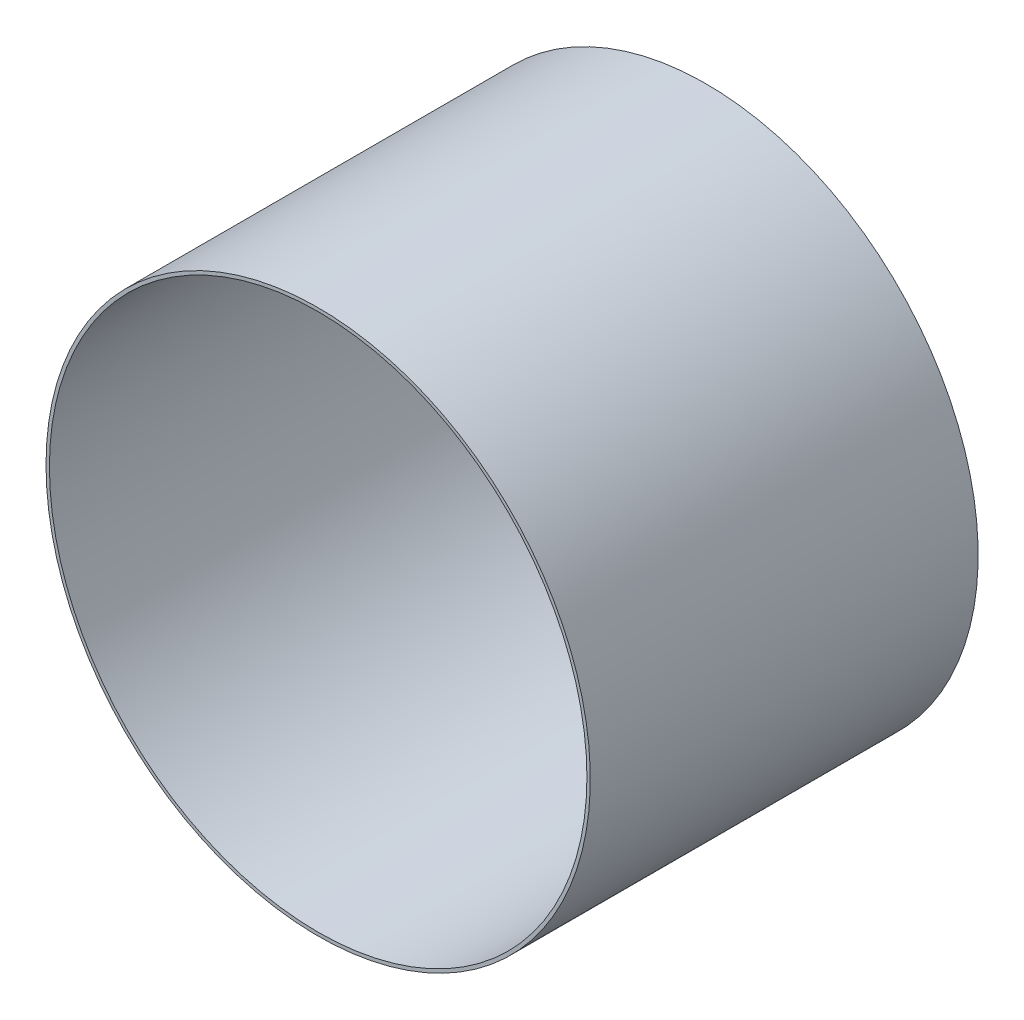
ISO-10303-21;
HEADER;
FILE_DESCRIPTION(('STEP AP214'),'2;1');
FILE_NAME('part.step','',(''),(''),'','','');
FILE_SCHEMA(('AUTOMOTIVE_DESIGN { 1 0 10303 214 1 1 1 1 }'));
ENDSEC;
DATA;
#1=APPLICATION_CONTEXT('core data for automotive mechanical design processes');
#2=APPLICATION_PROTOCOL_DEFINITION('international standard','automotive_design',2000,#1);
#3=PRODUCT_CONTEXT('',#1,'mechanical');
#4=PRODUCT('Part','Part','',(#3));
#5=PRODUCT_RELATED_PRODUCT_CATEGORY('part','',(#4));
#6=PRODUCT_DEFINITION_FORMATION('','',#4);
#7=PRODUCT_DEFINITION_CONTEXT('part definition',#1,'design');
#8=PRODUCT_DEFINITION('design','',#6,#7);
#9=PRODUCT_DEFINITION_SHAPE('','',#8);
#10=(LENGTH_UNIT() NAMED_UNIT(*) SI_UNIT(.MILLI.,.METRE.));
#11=(NAMED_UNIT(*) PLANE_ANGLE_UNIT() SI_UNIT($,.RADIAN.));
#12=(NAMED_UNIT(*) SI_UNIT($,.STERADIAN.) SOLID_ANGLE_UNIT());
#13=UNCERTAINTY_MEASURE_WITH_UNIT(LENGTH_MEASURE(1.E-05),#10,'distance_accuracy_value','');
#14=(GEOMETRIC_REPRESENTATION_CONTEXT(3) GLOBAL_UNCERTAINTY_ASSIGNED_CONTEXT((#13)) GLOBAL_UNIT_ASSIGNED_CONTEXT((#10,
#11,#12)) REPRESENTATION_CONTEXT('',''));
#15=CARTESIAN_POINT('',(0.,0.,0.));
#16=DIRECTION('',(0.,0.,1.));
#17=DIRECTION('',(1.,0.,0.));
#18=AXIS2_PLACEMENT_3D('',#15,#16,#17);
#19=CARTESIAN_POINT('',(0.,0.,228.));
#20=DIRECTION('',(0.,0.,1.));
#21=DIRECTION('',(1.,0.,0.));
#22=AXIS2_PLACEMENT_3D('',#19,#20,#21);
#23=PLANE('',#22);
#24=CARTESIAN_POINT('',(0.,0.,228.));
#25=DIRECTION('',(0.,0.,1.));
#26=DIRECTION('',(1.,0.,0.));
#27=AXIS2_PLACEMENT_3D('',#24,#25,#26);
#28=CIRCLE('',#27,160.);
#29=CARTESIAN_POINT('',(-160.,0.,228.));
#30=VERTEX_POINT('',#29);
#31=EDGE_CURVE('E10',#30,#30,#28,.T.);
#32=ORIENTED_EDGE('',*,*,#31,.T.);
#33=EDGE_LOOP('',(#32));
#34=FACE_BOUND('',#33,.T.);
#35=CARTESIAN_POINT('',(0.,0.,228.));
#36=DIRECTION('',(0.,0.,1.));
#37=DIRECTION('',(1.,0.,0.));
#38=AXIS2_PLACEMENT_3D('',#35,#36,#37);
#39=CIRCLE('',#38,158.);
#40=CARTESIAN_POINT('',(-158.,0.,228.));
#41=VERTEX_POINT('',#40);
#42=EDGE_CURVE('E41',#41,#41,#39,.T.);
#43=ORIENTED_EDGE('',*,*,#42,.F.);
#44=EDGE_LOOP('',(#43));
#45=FACE_BOUND('',#44,.T.);
#46=ADVANCED_FACE('F30',(#34,#45),#23,.T.);
#47=CARTESIAN_POINT('',(0.,0.,0.));
#48=DIRECTION('',(0.,0.,1.));
#49=DIRECTION('',(1.,0.,0.));
#50=AXIS2_PLACEMENT_3D('',#47,#48,#49);
#51=PLANE('',#50);
#52=CARTESIAN_POINT('',(0.,0.,0.));
#53=DIRECTION('',(0.,0.,1.));
#54=DIRECTION('',(1.,0.,0.));
#55=AXIS2_PLACEMENT_3D('',#52,#53,#54);
#56=CIRCLE('',#55,160.);
#57=CARTESIAN_POINT('',(-160.,0.,0.));
#58=VERTEX_POINT('',#57);
#59=EDGE_CURVE('E34',#58,#58,#56,.T.);
#60=ORIENTED_EDGE('',*,*,#59,.F.);
#61=EDGE_LOOP('',(#60));
#62=FACE_BOUND('',#61,.T.);
#63=CARTESIAN_POINT('',(0.,0.,0.));
#64=DIRECTION('',(0.,0.,1.));
#65=DIRECTION('',(1.,0.,0.));
#66=AXIS2_PLACEMENT_3D('',#63,#64,#65);
#67=CIRCLE('',#66,158.);
#68=CARTESIAN_POINT('',(-158.,0.,0.));
#69=VERTEX_POINT('',#68);
#70=EDGE_CURVE('E43',#69,#69,#67,.T.);
#71=ORIENTED_EDGE('',*,*,#70,.T.);
#72=EDGE_LOOP('',(#71));
#73=FACE_BOUND('',#72,.T.);
#74=ADVANCED_FACE('F53',(#62,#73),#51,.F.);
#75=CARTESIAN_POINT('',(0.,0.,228.));
#76=DIRECTION('',(0.,0.,-1.));
#77=DIRECTION('',(-1.,0.,0.));
#78=AXIS2_PLACEMENT_3D('',#75,#76,#77);
#79=CYLINDRICAL_SURFACE('',#78,160.);
#80=CARTESIAN_POINT('',(-160.,0.,228.));
#81=CARTESIAN_POINT('',(-160.,0.,225.625));
#82=CARTESIAN_POINT('',(-160.,0.,223.25));
#83=CARTESIAN_POINT('',(-160.,0.,218.5));
#84=CARTESIAN_POINT('',(-160.,0.,216.125));
#85=CARTESIAN_POINT('',(-160.,0.,211.375));
#86=CARTESIAN_POINT('',(-160.,0.,209.));
#87=CARTESIAN_POINT('',(-160.,0.,204.25));
#88=CARTESIAN_POINT('',(-160.,0.,201.875));
#89=CARTESIAN_POINT('',(-160.,0.,197.125));
#90=CARTESIAN_POINT('',(-160.,0.,194.75));
#91=CARTESIAN_POINT('',(-160.,0.,190.));
#92=CARTESIAN_POINT('',(-160.,0.,187.625));
#93=CARTESIAN_POINT('',(-160.,0.,182.875));
#94=CARTESIAN_POINT('',(-160.,0.,180.5));
#95=CARTESIAN_POINT('',(-160.,0.,175.75));
#96=CARTESIAN_POINT('',(-160.,0.,173.375));
#97=CARTESIAN_POINT('',(-160.,0.,168.625));
#98=CARTESIAN_POINT('',(-160.,0.,166.25));
#99=CARTESIAN_POINT('',(-160.,0.,161.5));
#100=CARTESIAN_POINT('',(-160.,0.,159.125));
#101=CARTESIAN_POINT('',(-160.,0.,154.375));
#102=CARTESIAN_POINT('',(-160.,0.,152.));
#103=CARTESIAN_POINT('',(-160.,0.,147.25));
#104=CARTESIAN_POINT('',(-160.,0.,144.875));
#105=CARTESIAN_POINT('',(-160.,0.,140.125));
#106=CARTESIAN_POINT('',(-160.,0.,137.75));
#107=CARTESIAN_POINT('',(-160.,0.,133.));
#108=CARTESIAN_POINT('',(-160.,0.,130.625));
#109=CARTESIAN_POINT('',(-160.,0.,125.875));
#110=CARTESIAN_POINT('',(-160.,0.,123.5));
#111=CARTESIAN_POINT('',(-160.,0.,118.75));
#112=CARTESIAN_POINT('',(-160.,0.,116.375));
#113=CARTESIAN_POINT('',(-160.,0.,111.625));
#114=CARTESIAN_POINT('',(-160.,0.,109.25));
#115=CARTESIAN_POINT('',(-160.,0.,104.5));
#116=CARTESIAN_POINT('',(-160.,0.,102.125));
#117=CARTESIAN_POINT('',(-160.,0.,97.375));
#118=CARTESIAN_POINT('',(-160.,0.,95.));
#119=CARTESIAN_POINT('',(-160.,0.,90.25));
#120=CARTESIAN_POINT('',(-160.,0.,87.875));
#121=CARTESIAN_POINT('',(-160.,0.,83.125));
#122=CARTESIAN_POINT('',(-160.,0.,80.75));
#123=CARTESIAN_POINT('',(-160.,0.,76.));
#124=CARTESIAN_POINT('',(-160.,0.,73.625));
#125=CARTESIAN_POINT('',(-160.,0.,68.875));
#126=CARTESIAN_POINT('',(-160.,0.,66.5));
#127=CARTESIAN_POINT('',(-160.,0.,61.75));
#128=CARTESIAN_POINT('',(-160.,0.,59.375));
#129=CARTESIAN_POINT('',(-160.,0.,54.625));
#130=CARTESIAN_POINT('',(-160.,0.,52.25));
#131=CARTESIAN_POINT('',(-160.,0.,47.5));
#132=CARTESIAN_POINT('',(-160.,0.,45.125));
#133=CARTESIAN_POINT('',(-160.,0.,40.375));
#134=CARTESIAN_POINT('',(-160.,0.,38.));
#135=CARTESIAN_POINT('',(-160.,0.,33.25));
#136=CARTESIAN_POINT('',(-160.,0.,30.875));
#137=CARTESIAN_POINT('',(-160.,0.,26.125));
#138=CARTESIAN_POINT('',(-160.,0.,23.75));
#139=CARTESIAN_POINT('',(-160.,0.,19.));
#140=CARTESIAN_POINT('',(-160.,0.,16.625));
#141=CARTESIAN_POINT('',(-160.,0.,11.875));
#142=CARTESIAN_POINT('',(-160.,0.,9.5));
#143=CARTESIAN_POINT('',(-160.,0.,4.75));
#144=CARTESIAN_POINT('',(-160.,0.,2.375));
#145=CARTESIAN_POINT('',(-160.,0.,0.));
#146=B_SPLINE_CURVE_WITH_KNOTS('',3,(#80,#81,#82,#83,#84,#85,#86,#87,#88,#89,#90,#91,#92,#93,
#94,#95,#96,#97,#98,#99,#100,#101,#102,#103,#104,#105,#106,#107,#108,#109,#110,#111,#112,#113,
#114,#115,#116,#117,#118,#119,#120,#121,#122,#123,#124,#125,#126,#127,#128,#129,#130,#131,#132,
#133,#134,#135,#136,#137,#138,#139,#140,#141,#142,#143,#144,#145),.UNSPECIFIED.,.F.,.F.,(4,2,2,
2,2,2,2,2,2,2,2,2,2,2,2,2,2,2,2,2,2,2,2,2,2,2,2,2,2,2,2,2,4),(0.,7.12500000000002,14.25,21.375,
28.5,35.625,42.75,49.875,57.,64.125,71.25,78.375,85.5,92.625,99.75,106.875,114.,121.125,128.25,
135.375,142.5,149.625,156.75,163.875,171.,178.125,185.25,192.375,199.5,206.625,213.75,220.875,
228.),.UNSPECIFIED.);
#147=EDGE_CURVE('BSEAM32',#30,#58,#146,.T.);
#148=ORIENTED_EDGE('',*,*,#31,.F.);
#149=ORIENTED_EDGE('',*,*,#59,.T.);
#150=ORIENTED_EDGE('',*,*,#147,.T.);
#151=ORIENTED_EDGE('',*,*,#147,.F.);
#152=EDGE_LOOP('',(#148,#150,#149,#151));
#153=FACE_BOUND('',#152,.T.);
#154=ADVANCED_FACE('F32',(#153),#79,.T.);
#155=CARTESIAN_POINT('',(0.,0.,228.));
#156=DIRECTION('',(0.,0.,-1.));
#157=DIRECTION('',(-1.,0.,0.));
#158=AXIS2_PLACEMENT_3D('',#155,#156,#157);
#159=CYLINDRICAL_SURFACE('',#158,158.);
#160=CARTESIAN_POINT('',(-158.,0.,228.));
#161=CARTESIAN_POINT('',(-158.,0.,225.625));
#162=CARTESIAN_POINT('',(-158.,0.,223.25));
#163=CARTESIAN_POINT('',(-158.,0.,218.5));
#164=CARTESIAN_POINT('',(-158.,0.,216.125));
#165=CARTESIAN_POINT('',(-158.,0.,211.375));
#166=CARTESIAN_POINT('',(-158.,0.,209.));
#167=CARTESIAN_POINT('',(-158.,0.,204.25));
#168=CARTESIAN_POINT('',(-158.,0.,201.875));
#169=CARTESIAN_POINT('',(-158.,0.,197.125));
#170=CARTESIAN_POINT('',(-158.,0.,194.75));
#171=CARTESIAN_POINT('',(-158.,0.,190.));
#172=CARTESIAN_POINT('',(-158.,0.,187.625));
#173=CARTESIAN_POINT('',(-158.,0.,182.875));
#174=CARTESIAN_POINT('',(-158.,0.,180.5));
#175=CARTESIAN_POINT('',(-158.,0.,175.75));
#176=CARTESIAN_POINT('',(-158.,0.,173.375));
#177=CARTESIAN_POINT('',(-158.,0.,168.625));
#178=CARTESIAN_POINT('',(-158.,0.,166.25));
#179=CARTESIAN_POINT('',(-158.,0.,161.5));
#180=CARTESIAN_POINT('',(-158.,0.,159.125));
#181=CARTESIAN_POINT('',(-158.,0.,154.375));
#182=CARTESIAN_POINT('',(-158.,0.,152.));
#183=CARTESIAN_POINT('',(-158.,0.,147.25));
#184=CARTESIAN_POINT('',(-158.,0.,144.875));
#185=CARTESIAN_POINT('',(-158.,0.,140.125));
#186=CARTESIAN_POINT('',(-158.,0.,137.75));
#187=CARTESIAN_POINT('',(-158.,0.,133.));
#188=CARTESIAN_POINT('',(-158.,0.,130.625));
#189=CARTESIAN_POINT('',(-158.,0.,125.875));
#190=CARTESIAN_POINT('',(-158.,0.,123.5));
#191=CARTESIAN_POINT('',(-158.,0.,118.75));
#192=CARTESIAN_POINT('',(-158.,0.,116.375));
#193=CARTESIAN_POINT('',(-158.,0.,111.625));
#194=CARTESIAN_POINT('',(-158.,0.,109.25));
#195=CARTESIAN_POINT('',(-158.,0.,104.5));
#196=CARTESIAN_POINT('',(-158.,0.,102.125));
#197=CARTESIAN_POINT('',(-158.,0.,97.375));
#198=CARTESIAN_POINT('',(-158.,0.,95.));
#199=CARTESIAN_POINT('',(-158.,0.,90.25));
#200=CARTESIAN_POINT('',(-158.,0.,87.875));
#201=CARTESIAN_POINT('',(-158.,0.,83.125));
#202=CARTESIAN_POINT('',(-158.,0.,80.75));
#203=CARTESIAN_POINT('',(-158.,0.,76.));
#204=CARTESIAN_POINT('',(-158.,0.,73.625));
#205=CARTESIAN_POINT('',(-158.,0.,68.875));
#206=CARTESIAN_POINT('',(-158.,0.,66.5));
#207=CARTESIAN_POINT('',(-158.,0.,61.75));
#208=CARTESIAN_POINT('',(-158.,0.,59.375));
#209=CARTESIAN_POINT('',(-158.,0.,54.625));
#210=CARTESIAN_POINT('',(-158.,0.,52.25));
#211=CARTESIAN_POINT('',(-158.,0.,47.5));
#212=CARTESIAN_POINT('',(-158.,0.,45.125));
#213=CARTESIAN_POINT('',(-158.,0.,40.375));
#214=CARTESIAN_POINT('',(-158.,0.,38.));
#215=CARTESIAN_POINT('',(-158.,0.,33.25));
#216=CARTESIAN_POINT('',(-158.,0.,30.875));
#217=CARTESIAN_POINT('',(-158.,0.,26.125));
#218=CARTESIAN_POINT('',(-158.,0.,23.75));
#219=CARTESIAN_POINT('',(-158.,0.,19.));
#220=CARTESIAN_POINT('',(-158.,0.,16.625));
#221=CARTESIAN_POINT('',(-158.,0.,11.875));
#222=CARTESIAN_POINT('',(-158.,0.,9.5));
#223=CARTESIAN_POINT('',(-158.,0.,4.75));
#224=CARTESIAN_POINT('',(-158.,0.,2.375));
#225=CARTESIAN_POINT('',(-158.,0.,0.));
#226=B_SPLINE_CURVE_WITH_KNOTS('',3,(#160,#161,#162,#163,#164,#165,#166,#167,#168,#169,#170,
#171,#172,#173,#174,#175,#176,#177,#178,#179,#180,#181,#182,#183,#184,#185,#186,#187,#188,#189,
#190,#191,#192,#193,#194,#195,#196,#197,#198,#199,#200,#201,#202,#203,#204,#205,#206,#207,#208,
#209,#210,#211,#212,#213,#214,#215,#216,#217,#218,#219,#220,#221,#222,#223,#224,#225),
.UNSPECIFIED.,.F.,.F.,(4,2,2,2,2,2,2,2,2,2,2,2,2,2,2,2,2,2,2,2,2,2,2,2,2,2,2,2,2,2,2,2,4),(0.,
7.12500000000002,14.25,21.375,28.5,35.625,42.75,49.875,57.,64.125,71.25,78.375,85.5,92.625,
99.75,106.875,114.,121.125,128.25,135.375,142.5,149.625,156.75,163.875,171.,178.125,185.25,
192.375,199.5,206.625,213.75,220.875,228.),.UNSPECIFIED.);
#227=EDGE_CURVE('BSEAM49',#41,#69,#226,.T.);
#228=ORIENTED_EDGE('',*,*,#42,.T.);
#229=ORIENTED_EDGE('',*,*,#70,.F.);
#230=ORIENTED_EDGE('',*,*,#227,.T.);
#231=ORIENTED_EDGE('',*,*,#227,.F.);
#232=EDGE_LOOP('',(#228,#230,#229,#231));
#233=FACE_BOUND('',#232,.T.);
#234=ADVANCED_FACE('F49',(#233),#159,.F.);
#235=CLOSED_SHELL('',(#46,#74,#154,#234));
#236=MANIFOLD_SOLID_BREP('B2',#235);
#237=ADVANCED_BREP_SHAPE_REPRESENTATION('',(#18,#236),#14);
#238=SHAPE_DEFINITION_REPRESENTATION(#9,#237);
ENDSEC;
END-ISO-10303-21;
